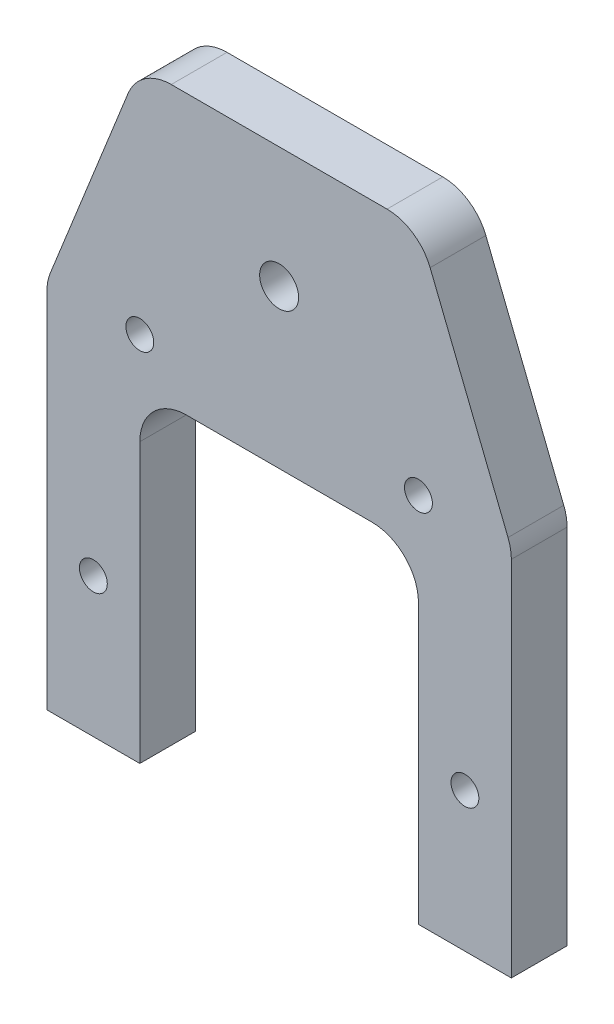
from build123d import *

# Parameters (mm, degrees)
ESQUISSE1_R             = 1.5
ESQUISSE1_R_2           = 2.1
EXTRUSION1_DEPTH        = 6
ENL_V_MAT_EXTRU_3_DEPTH = 10


with BuildPart() as part:
    # Esquisse1 → Extrusion1 (new body)
    with BuildSketch(Plane.XY):
        with BuildLine():
            Line((0, 0), (0, 39.037087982))
            ThreePointArc((0, 39.037087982), (0.090218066, 39.982625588), (0.357616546, 40.894041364))
            Line((0.357616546, 40.894041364), (8.742781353, 61.856953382))
            ThreePointArc((8.742781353, 61.856953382), (10.582020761, 64.140336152), (13.385164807, 65))
            Line((13.385164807, 65), (36.614835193, 65))
            ThreePointArc((36.614835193, 65), (39.417979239, 64.140336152), (41.257218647, 61.856953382))
            Line((41.257218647, 61.856953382), (49.642383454, 40.894041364))
            ThreePointArc((49.642383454, 40.894041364), (49.909781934, 39.982625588), (50, 39.037087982))
            Line((50, 39.037087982), (50, 0))
            Line((50, 0), (0, 0))
        make_face()
        with Locations((10, 40)):
            Circle(ESQUISSE1_R, mode=Mode.SUBTRACT)
        with Locations((40, 40)):
            Circle(ESQUISSE1_R, mode=Mode.SUBTRACT)
        with Locations((5, 15)):
            Circle(ESQUISSE1_R, mode=Mode.SUBTRACT)
        with Locations((45, 15)):
            Circle(ESQUISSE1_R, mode=Mode.SUBTRACT)
        with Locations((25, 52)):
            Circle(ESQUISSE1_R_2, mode=Mode.SUBTRACT)
    extrude(amount=EXTRUSION1_DEPTH)

    # Esquisse5 → Enl_v. mat.-Extru.3 (cut)
    with BuildSketch(Plane.XY.offset(6)):
        with BuildLine():
            Line((15, 35), (35, 35))
            ThreePointArc((35, 35), (38.535533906, 33.535533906), (40, 30))
            Line((40, 30), (40, 0))
            Line((40, 0), (10, 0))
            Line((10, 0), (10, 30))
            ThreePointArc((10, 30), (11.464466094, 33.535533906), (15, 35))
        make_face()
    extrude(amount=-ENL_V_MAT_EXTRU_3_DEPTH, mode=Mode.SUBTRACT)


solid = part.part
